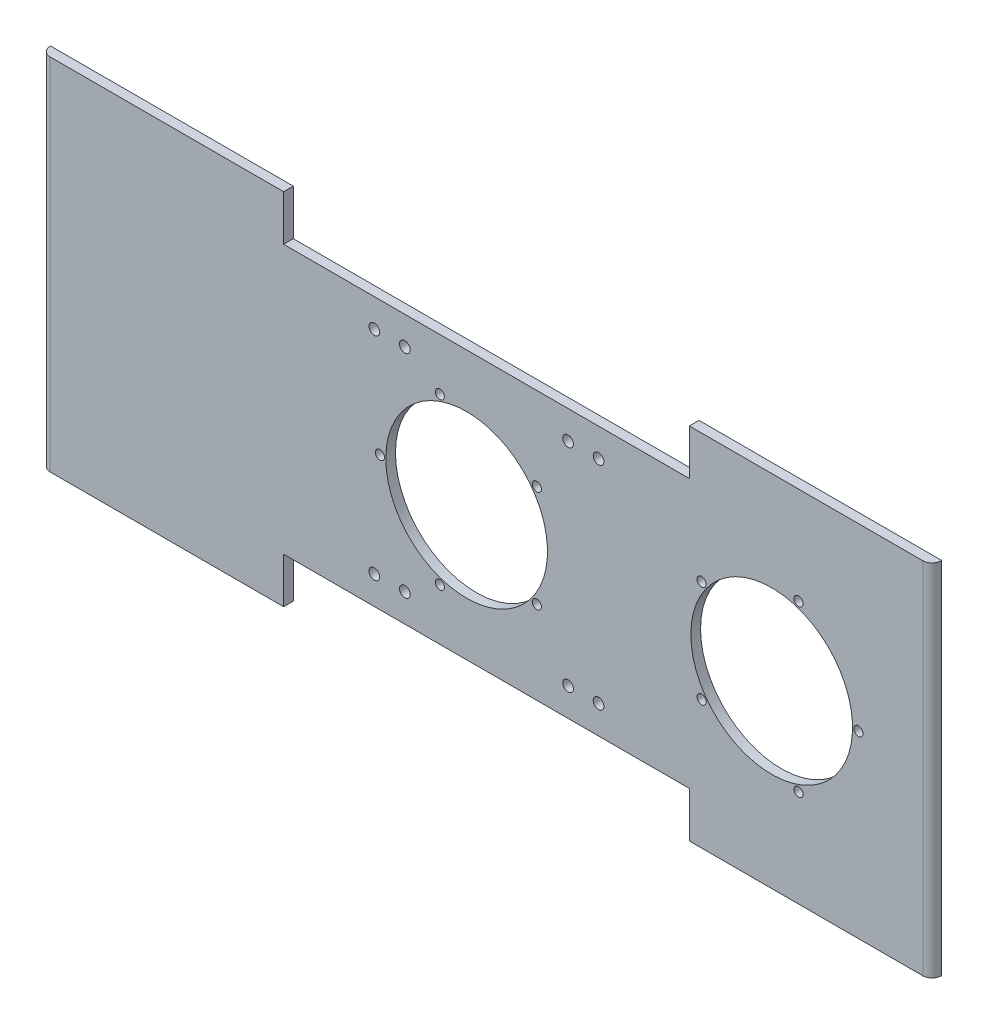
ISO-10303-21;
HEADER;
FILE_DESCRIPTION(('STEP AP214'),'2;1');
FILE_NAME('part.step','',(''),(''),'','','');
FILE_SCHEMA(('AUTOMOTIVE_DESIGN { 1 0 10303 214 1 1 1 1 }'));
ENDSEC;
DATA;
#1=APPLICATION_CONTEXT('core data for automotive mechanical design processes');
#2=APPLICATION_PROTOCOL_DEFINITION('international standard','automotive_design',2000,#1);
#3=PRODUCT_CONTEXT('',#1,'mechanical');
#4=PRODUCT('Part','Part','',(#3));
#5=PRODUCT_RELATED_PRODUCT_CATEGORY('part','',(#4));
#6=PRODUCT_DEFINITION_FORMATION('','',#4);
#7=PRODUCT_DEFINITION_CONTEXT('part definition',#1,'design');
#8=PRODUCT_DEFINITION('design','',#6,#7);
#9=PRODUCT_DEFINITION_SHAPE('','',#8);
#10=(LENGTH_UNIT() NAMED_UNIT(*) SI_UNIT(.MILLI.,.METRE.));
#11=(NAMED_UNIT(*) PLANE_ANGLE_UNIT() SI_UNIT($,.RADIAN.));
#12=(NAMED_UNIT(*) SI_UNIT($,.STERADIAN.) SOLID_ANGLE_UNIT());
#13=UNCERTAINTY_MEASURE_WITH_UNIT(LENGTH_MEASURE(1.E-05),#10,'distance_accuracy_value','');
#14=(GEOMETRIC_REPRESENTATION_CONTEXT(3) GLOBAL_UNCERTAINTY_ASSIGNED_CONTEXT((#13)) GLOBAL_UNIT_ASSIGNED_CONTEXT((#10,
#11,#12)) REPRESENTATION_CONTEXT('',''));
#15=CARTESIAN_POINT('',(0.,0.,0.));
#16=DIRECTION('',(0.,0.,1.));
#17=DIRECTION('',(1.,0.,0.));
#18=AXIS2_PLACEMENT_3D('',#15,#16,#17);
#19=CARTESIAN_POINT('',(0.,58.9125,-240.705250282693));
#20=DIRECTION('',(0.,1.,0.));
#21=DIRECTION('',(0.,0.,1.));
#22=AXIS2_PLACEMENT_3D('',#19,#20,#21);
#23=PLANE('',#22);
#24=DIRECTION('',(0.,0.,1.));
#25=VECTOR('',#24,1.);
#26=CARTESIAN_POINT('',(-146.05,58.9125,0.));
#27=LINE('',#26,#25);
#28=CARTESIAN_POINT('',(-146.05,58.9125,142.875));
#29=VERTEX_POINT('',#28);
#30=CARTESIAN_POINT('',(-146.05,58.9125,143.05));
#31=VERTEX_POINT('',#30);
#32=EDGE_CURVE('E211',#29,#31,#27,.T.);
#33=ORIENTED_EDGE('',*,*,#32,.T.);
#34=CARTESIAN_POINT('',(-143.05,58.9125,143.05));
#35=DIRECTION('',(0.,1.,0.));
#36=DIRECTION('',(0.,0.,1.));
#37=AXIS2_PLACEMENT_3D('',#34,#35,#36);
#38=CIRCLE('',#37,3.);
#39=CARTESIAN_POINT('',(-143.05,58.9125,146.05));
#40=VERTEX_POINT('',#39);
#41=EDGE_CURVE('E11',#31,#40,#38,.T.);
#42=ORIENTED_EDGE('',*,*,#41,.T.);
#43=DIRECTION('',(1.,0.,0.));
#44=VECTOR('',#43,1.);
#45=CARTESIAN_POINT('',(0.,58.9125,146.05));
#46=LINE('',#45,#44);
#47=CARTESIAN_POINT('',(-66.5,58.9125,146.05));
#48=VERTEX_POINT('',#47);
#49=EDGE_CURVE('E222',#40,#48,#46,.T.);
#50=ORIENTED_EDGE('',*,*,#49,.T.);
#51=DIRECTION('',(0.,0.,1.));
#52=VECTOR('',#51,1.);
#53=CARTESIAN_POINT('',(-66.5,58.9125,8.67285394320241));
#54=LINE('',#53,#52);
#55=CARTESIAN_POINT('',(-66.5,58.9125,142.875));
#56=VERTEX_POINT('',#55);
#57=EDGE_CURVE('E179',#56,#48,#54,.T.);
#58=ORIENTED_EDGE('',*,*,#57,.F.);
#59=DIRECTION('',(1.,0.,0.));
#60=VECTOR('',#59,1.);
#61=CARTESIAN_POINT('',(0.,58.9125,142.875));
#62=LINE('',#61,#60);
#63=EDGE_CURVE('E215',#29,#56,#62,.T.);
#64=ORIENTED_EDGE('',*,*,#63,.F.);
#65=EDGE_LOOP('',(#33,#42,#50,#58,#64));
#66=FACE_BOUND('',#65,.T.);
#67=ADVANCED_FACE('F36',(#66),#23,.T.);
#68=CARTESIAN_POINT('',(0.,-58.9125,-240.705250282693));
#69=DIRECTION('',(0.,-1.,0.));
#70=DIRECTION('',(0.,0.,1.));
#71=AXIS2_PLACEMENT_3D('',#68,#69,#70);
#72=PLANE('',#71);
#73=DIRECTION('',(0.,0.,1.));
#74=VECTOR('',#73,1.);
#75=CARTESIAN_POINT('',(146.05,-58.9125,0.));
#76=LINE('',#75,#74);
#77=CARTESIAN_POINT('',(146.05,-58.9125,142.875));
#78=VERTEX_POINT('',#77);
#79=CARTESIAN_POINT('',(146.05,-58.9125,143.05));
#80=VERTEX_POINT('',#79);
#81=EDGE_CURVE('E204',#78,#80,#76,.T.);
#82=ORIENTED_EDGE('',*,*,#81,.T.);
#83=CARTESIAN_POINT('',(143.05,-58.9125,143.05));
#84=DIRECTION('',(0.,-1.,0.));
#85=DIRECTION('',(0.,0.,-1.));
#86=AXIS2_PLACEMENT_3D('',#83,#84,#85);
#87=CIRCLE('',#86,3.);
#88=CARTESIAN_POINT('',(143.05,-58.9125,146.05));
#89=VERTEX_POINT('',#88);
#90=EDGE_CURVE('E243',#80,#89,#87,.T.);
#91=ORIENTED_EDGE('',*,*,#90,.T.);
#92=DIRECTION('',(1.,0.,0.));
#93=VECTOR('',#92,1.);
#94=CARTESIAN_POINT('',(0.,-58.9125,146.05));
#95=LINE('',#94,#93);
#96=CARTESIAN_POINT('',(66.5,-58.9125,146.05));
#97=VERTEX_POINT('',#96);
#98=EDGE_CURVE('E171',#97,#89,#95,.T.);
#99=ORIENTED_EDGE('',*,*,#98,.F.);
#100=DIRECTION('',(0.,0.,1.));
#101=VECTOR('',#100,1.);
#102=CARTESIAN_POINT('',(66.5,-58.9125,-240.705250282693));
#103=LINE('',#102,#101);
#104=CARTESIAN_POINT('',(66.5,-58.9125,142.875));
#105=VERTEX_POINT('',#104);
#106=EDGE_CURVE('E229',#105,#97,#103,.T.);
#107=ORIENTED_EDGE('',*,*,#106,.F.);
#108=DIRECTION('',(1.,0.,0.));
#109=VECTOR('',#108,1.);
#110=CARTESIAN_POINT('',(0.,-58.9125,142.875));
#111=LINE('',#110,#109);
#112=EDGE_CURVE('E202',#105,#78,#111,.T.);
#113=ORIENTED_EDGE('',*,*,#112,.T.);
#114=EDGE_LOOP('',(#82,#91,#99,#107,#113));
#115=FACE_BOUND('',#114,.T.);
#116=ADVANCED_FACE('F268',(#115),#72,.T.);
#117=CARTESIAN_POINT('',(146.05,351.029754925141,0.));
#118=DIRECTION('',(1.,0.,0.));
#119=DIRECTION('',(0.,0.,-1.));
#120=AXIS2_PLACEMENT_3D('',#117,#118,#119);
#121=PLANE('',#120);
#122=DIRECTION('',(0.,0.,1.));
#123=VECTOR('',#122,1.);
#124=CARTESIAN_POINT('',(146.05,58.9125,0.));
#125=LINE('',#124,#123);
#126=CARTESIAN_POINT('',(146.05,58.9125,142.875));
#127=VERTEX_POINT('',#126);
#128=CARTESIAN_POINT('',(146.05,58.9125,143.05));
#129=VERTEX_POINT('',#128);
#130=EDGE_CURVE('E207',#127,#129,#125,.T.);
#131=ORIENTED_EDGE('',*,*,#130,.T.);
#132=DIRECTION('',(0.,-1.,0.));
#133=VECTOR('',#132,1.);
#134=CARTESIAN_POINT('',(146.05,-58.9125,143.05));
#135=LINE('',#134,#133);
#136=EDGE_CURVE('E231',#129,#80,#135,.T.);
#137=ORIENTED_EDGE('',*,*,#136,.T.);
#138=ORIENTED_EDGE('',*,*,#81,.F.);
#139=DIRECTION('',(0.,-1.,0.));
#140=VECTOR('',#139,1.);
#141=CARTESIAN_POINT('',(146.05,351.029754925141,142.875));
#142=LINE('',#141,#140);
#143=EDGE_CURVE('E218',#127,#78,#142,.T.);
#144=ORIENTED_EDGE('',*,*,#143,.F.);
#145=EDGE_LOOP('',(#131,#137,#138,#144));
#146=FACE_BOUND('',#145,.T.);
#147=ADVANCED_FACE('F263',(#146),#121,.T.);
#148=CARTESIAN_POINT('',(0.,351.029754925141,142.875));
#149=DIRECTION('',(0.,0.,-1.));
#150=DIRECTION('',(-1.,0.,0.));
#151=AXIS2_PLACEMENT_3D('',#148,#149,#150);
#152=PLANE('',#151);
#153=CARTESIAN_POINT('',(36.75,-34.74,142.875));
#154=DIRECTION('',(0.,0.,-1.));
#155=DIRECTION('',(-1.,0.,0.));
#156=AXIS2_PLACEMENT_3D('',#153,#154,#155);
#157=CIRCLE('',#156,1.75);
#158=CARTESIAN_POINT('',(35.,-34.74,142.875));
#159=VERTEX_POINT('',#158);
#160=EDGE_CURVE('E550',#159,#159,#157,.F.);
#161=ORIENTED_EDGE('',*,*,#160,.T.);
#162=EDGE_LOOP('',(#161));
#163=FACE_BOUND('',#162,.T.);
#164=CARTESIAN_POINT('',(26.75,-34.74,142.875));
#165=DIRECTION('',(0.,0.,-1.));
#166=DIRECTION('',(-1.,0.,0.));
#167=AXIS2_PLACEMENT_3D('',#164,#165,#166);
#168=CIRCLE('',#167,1.75);
#169=CARTESIAN_POINT('',(25.,-34.74,142.875));
#170=VERTEX_POINT('',#169);
#171=EDGE_CURVE('E560',#170,#170,#168,.F.);
#172=ORIENTED_EDGE('',*,*,#171,.T.);
#173=EDGE_LOOP('',(#172));
#174=FACE_BOUND('',#173,.T.);
#175=CARTESIAN_POINT('',(-26.75,-34.74,142.875));
#176=DIRECTION('',(0.,0.,-1.));
#177=DIRECTION('',(-1.,0.,0.));
#178=AXIS2_PLACEMENT_3D('',#175,#176,#177);
#179=CIRCLE('',#178,1.75);
#180=CARTESIAN_POINT('',(-28.5,-34.74,142.875));
#181=VERTEX_POINT('',#180);
#182=EDGE_CURVE('E566',#181,#181,#179,.F.);
#183=ORIENTED_EDGE('',*,*,#182,.T.);
#184=EDGE_LOOP('',(#183));
#185=FACE_BOUND('',#184,.T.);
#186=CARTESIAN_POINT('',(-36.75,-34.74,142.875));
#187=DIRECTION('',(0.,0.,-1.));
#188=DIRECTION('',(-1.,0.,0.));
#189=AXIS2_PLACEMENT_3D('',#186,#187,#188);
#190=CIRCLE('',#189,1.75);
#191=CARTESIAN_POINT('',(-38.5,-34.74,142.875));
#192=VERTEX_POINT('',#191);
#193=EDGE_CURVE('E572',#192,#192,#190,.F.);
#194=ORIENTED_EDGE('',*,*,#193,.T.);
#195=EDGE_LOOP('',(#194));
#196=FACE_BOUND('',#195,.T.);
#197=CARTESIAN_POINT('',(-36.75,34.74,142.875));
#198=DIRECTION('',(0.,0.,-1.));
#199=DIRECTION('',(-1.,0.,0.));
#200=AXIS2_PLACEMENT_3D('',#197,#198,#199);
#201=CIRCLE('',#200,1.75);
#202=CARTESIAN_POINT('',(-38.5,34.74,142.875));
#203=VERTEX_POINT('',#202);
#204=EDGE_CURVE('E578',#203,#203,#201,.F.);
#205=ORIENTED_EDGE('',*,*,#204,.T.);
#206=EDGE_LOOP('',(#205));
#207=FACE_BOUND('',#206,.T.);
#208=CARTESIAN_POINT('',(-26.75,34.74,142.875));
#209=DIRECTION('',(0.,0.,-1.));
#210=DIRECTION('',(-1.,0.,0.));
#211=AXIS2_PLACEMENT_3D('',#208,#209,#210);
#212=CIRCLE('',#211,1.75);
#213=CARTESIAN_POINT('',(-28.5,34.74,142.875));
#214=VERTEX_POINT('',#213);
#215=EDGE_CURVE('E584',#214,#214,#212,.F.);
#216=ORIENTED_EDGE('',*,*,#215,.T.);
#217=EDGE_LOOP('',(#216));
#218=FACE_BOUND('',#217,.T.);
#219=CARTESIAN_POINT('',(26.75,34.74,142.875));
#220=DIRECTION('',(0.,0.,-1.));
#221=DIRECTION('',(-1.,0.,0.));
#222=AXIS2_PLACEMENT_3D('',#219,#220,#221);
#223=CIRCLE('',#222,1.75);
#224=CARTESIAN_POINT('',(25.,34.74,142.875));
#225=VERTEX_POINT('',#224);
#226=EDGE_CURVE('E590',#225,#225,#223,.F.);
#227=ORIENTED_EDGE('',*,*,#226,.T.);
#228=EDGE_LOOP('',(#227));
#229=FACE_BOUND('',#228,.T.);
#230=CARTESIAN_POINT('',(36.75,34.74,142.875));
#231=DIRECTION('',(0.,0.,-1.));
#232=DIRECTION('',(-1.,0.,0.));
#233=AXIS2_PLACEMENT_3D('',#230,#231,#232);
#234=CIRCLE('',#233,1.75);
#235=CARTESIAN_POINT('',(35.,34.74,142.875));
#236=VERTEX_POINT('',#235);
#237=EDGE_CURVE('E596',#236,#236,#234,.F.);
#238=ORIENTED_EDGE('',*,*,#237,.T.);
#239=EDGE_LOOP('',(#238));
#240=FACE_BOUND('',#239,.T.);
#241=CARTESIAN_POINT('',(-6.50000000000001,0.,142.875));
#242=DIRECTION('',(0.,0.,-1.));
#243=DIRECTION('',(-1.,0.,0.));
#244=AXIS2_PLACEMENT_3D('',#241,#242,#243);
#245=CIRCLE('',#244,26.5);
#246=CARTESIAN_POINT('',(-33.,0.,142.875));
#247=VERTEX_POINT('',#246);
#248=EDGE_CURVE('E240',#247,#247,#245,.T.);
#249=ORIENTED_EDGE('',*,*,#248,.F.);
#250=EDGE_LOOP('',(#249));
#251=FACE_BOUND('',#250,.T.);
#252=CARTESIAN_POINT('',(93.5,0.,142.875));
#253=DIRECTION('',(0.,0.,-1.));
#254=DIRECTION('',(-1.,0.,0.));
#255=AXIS2_PLACEMENT_3D('',#252,#253,#254);
#256=CIRCLE('',#255,26.5);
#257=CARTESIAN_POINT('',(67.,0.,142.875));
#258=VERTEX_POINT('',#257);
#259=EDGE_CURVE('E235',#258,#258,#256,.T.);
#260=ORIENTED_EDGE('',*,*,#259,.F.);
#261=EDGE_LOOP('',(#260));
#262=FACE_BOUND('',#261,.T.);
#263=CARTESIAN_POINT('',(16.4963080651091,16.7077957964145,142.875));
#264=DIRECTION('',(0.,0.,-1.));
#265=DIRECTION('',(-1.,0.,0.));
#266=AXIS2_PLACEMENT_3D('',#263,#264,#265);
#267=CIRCLE('',#266,1.5);
#268=CARTESIAN_POINT('',(14.9963080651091,16.7077957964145,142.875));
#269=VERTEX_POINT('',#268);
#270=EDGE_CURVE('E613',#269,#269,#267,.F.);
#271=ORIENTED_EDGE('',*,*,#270,.T.);
#272=EDGE_LOOP('',(#271));
#273=FACE_BOUND('',#272,.T.);
#274=CARTESIAN_POINT('',(16.4963080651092,-16.7077957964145,142.875));
#275=DIRECTION('',(0.,0.,-1.));
#276=DIRECTION('',(-1.,0.,0.));
#277=AXIS2_PLACEMENT_3D('',#274,#275,#276);
#278=CIRCLE('',#277,1.5);
#279=CARTESIAN_POINT('',(14.9963080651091,-16.7077957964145,142.875));
#280=VERTEX_POINT('',#279);
#281=EDGE_CURVE('E619',#280,#280,#278,.F.);
#282=ORIENTED_EDGE('',*,*,#281,.T.);
#283=EDGE_LOOP('',(#282));
#284=FACE_BOUND('',#283,.T.);
#285=CARTESIAN_POINT('',(-15.2838080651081,-27.0337814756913,142.875));
#286=DIRECTION('',(0.,0.,-1.));
#287=DIRECTION('',(-1.,0.,0.));
#288=AXIS2_PLACEMENT_3D('',#285,#286,#287);
#289=CIRCLE('',#288,1.5);
#290=CARTESIAN_POINT('',(-16.7838080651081,-27.0337814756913,142.875));
#291=VERTEX_POINT('',#290);
#292=EDGE_CURVE('E625',#291,#291,#289,.F.);
#293=ORIENTED_EDGE('',*,*,#292,.T.);
#294=EDGE_LOOP('',(#293));
#295=FACE_BOUND('',#294,.T.);
#296=CARTESIAN_POINT('',(-34.9250000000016,-1.65882932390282E-13,142.875));
#297=DIRECTION('',(0.,0.,-1.));
#298=DIRECTION('',(-1.,0.,0.));
#299=AXIS2_PLACEMENT_3D('',#296,#297,#298);
#300=CIRCLE('',#299,1.50000000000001);
#301=CARTESIAN_POINT('',(-36.4250000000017,-1.65882932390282E-13,142.875));
#302=VERTEX_POINT('',#301);
#303=EDGE_CURVE('E631',#302,#302,#300,.F.);
#304=ORIENTED_EDGE('',*,*,#303,.T.);
#305=EDGE_LOOP('',(#304));
#306=FACE_BOUND('',#305,.T.);
#307=CARTESIAN_POINT('',(102.283808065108,27.0337814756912,142.875));
#308=DIRECTION('',(0.,0.,-1.));
#309=DIRECTION('',(-1.,0.,0.));
#310=AXIS2_PLACEMENT_3D('',#307,#308,#309);
#311=CIRCLE('',#310,1.5);
#312=CARTESIAN_POINT('',(100.783808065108,27.0337814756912,142.875));
#313=VERTEX_POINT('',#312);
#314=EDGE_CURVE('E637',#313,#313,#311,.F.);
#315=ORIENTED_EDGE('',*,*,#314,.T.);
#316=EDGE_LOOP('',(#315));
#317=FACE_BOUND('',#316,.T.);
#318=CARTESIAN_POINT('',(121.925000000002,-1.83880688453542E-13,142.875));
#319=DIRECTION('',(0.,0.,-1.));
#320=DIRECTION('',(-1.,0.,0.));
#321=AXIS2_PLACEMENT_3D('',#318,#319,#320);
#322=CIRCLE('',#321,1.50000000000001);
#323=CARTESIAN_POINT('',(120.425000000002,-1.83880688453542E-13,142.875));
#324=VERTEX_POINT('',#323);
#325=EDGE_CURVE('E643',#324,#324,#322,.F.);
#326=ORIENTED_EDGE('',*,*,#325,.T.);
#327=EDGE_LOOP('',(#326));
#328=FACE_BOUND('',#327,.T.);
#329=CARTESIAN_POINT('',(70.5036919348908,16.7077957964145,142.875));
#330=DIRECTION('',(0.,0.,-1.));
#331=DIRECTION('',(-1.,0.,0.));
#332=AXIS2_PLACEMENT_3D('',#329,#330,#331);
#333=CIRCLE('',#332,1.5);
#334=CARTESIAN_POINT('',(69.0036919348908,16.7077957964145,142.875));
#335=VERTEX_POINT('',#334);
#336=EDGE_CURVE('E649',#335,#335,#333,.F.);
#337=ORIENTED_EDGE('',*,*,#336,.T.);
#338=EDGE_LOOP('',(#337));
#339=FACE_BOUND('',#338,.T.);
#340=CARTESIAN_POINT('',(70.5036919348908,-16.7077957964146,142.875));
#341=DIRECTION('',(0.,0.,-1.));
#342=DIRECTION('',(-1.,0.,0.));
#343=AXIS2_PLACEMENT_3D('',#340,#341,#342);
#344=CIRCLE('',#343,1.50000000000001);
#345=CARTESIAN_POINT('',(69.0036919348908,-16.7077957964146,142.875));
#346=VERTEX_POINT('',#345);
#347=EDGE_CURVE('E606',#346,#346,#344,.F.);
#348=ORIENTED_EDGE('',*,*,#347,.T.);
#349=EDGE_LOOP('',(#348));
#350=FACE_BOUND('',#349,.T.);
#351=CARTESIAN_POINT('',(102.283808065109,-27.0337814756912,142.875));
#352=DIRECTION('',(0.,0.,-1.));
#353=DIRECTION('',(-1.,0.,0.));
#354=AXIS2_PLACEMENT_3D('',#351,#352,#353);
#355=CIRCLE('',#354,1.50000000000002);
#356=CARTESIAN_POINT('',(100.783808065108,-27.0337814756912,142.875));
#357=VERTEX_POINT('',#356);
#358=EDGE_CURVE('E602',#357,#357,#355,.F.);
#359=ORIENTED_EDGE('',*,*,#358,.T.);
#360=EDGE_LOOP('',(#359));
#361=FACE_BOUND('',#360,.T.);
#362=CARTESIAN_POINT('',(-15.2838080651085,27.0337814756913,142.875));
#363=DIRECTION('',(0.,0.,-1.));
#364=DIRECTION('',(-1.,0.,0.));
#365=AXIS2_PLACEMENT_3D('',#362,#363,#364);
#366=CIRCLE('',#365,1.5);
#367=CARTESIAN_POINT('',(-16.7838080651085,27.0337814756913,142.875));
#368=VERTEX_POINT('',#367);
#369=EDGE_CURVE('E612',#368,#368,#366,.F.);
#370=ORIENTED_EDGE('',*,*,#369,.T.);
#371=EDGE_LOOP('',(#370));
#372=FACE_BOUND('',#371,.T.);
#373=DIRECTION('',(0.,1.,0.));
#374=VECTOR('',#373,1.);
#375=CARTESIAN_POINT('',(66.5,-43.99,142.875));
#376=LINE('',#375,#374);
#377=CARTESIAN_POINT('',(66.5,-43.99,142.875));
#378=VERTEX_POINT('',#377);
#379=EDGE_CURVE('E156',#105,#378,#376,.T.);
#380=ORIENTED_EDGE('',*,*,#379,.T.);
#381=DIRECTION('',(-1.,0.,0.));
#382=VECTOR('',#381,1.);
#383=CARTESIAN_POINT('',(-66.5,-43.99,142.875));
#384=LINE('',#383,#382);
#385=CARTESIAN_POINT('',(-66.5,-43.99,142.875));
#386=VERTEX_POINT('',#385);
#387=EDGE_CURVE('E146',#378,#386,#384,.T.);
#388=ORIENTED_EDGE('',*,*,#387,.T.);
#389=DIRECTION('',(0.,-1.,0.));
#390=VECTOR('',#389,1.);
#391=CARTESIAN_POINT('',(-66.5,-43.99,142.875));
#392=LINE('',#391,#390);
#393=CARTESIAN_POINT('',(-66.5,-58.9125,142.875));
#394=VERTEX_POINT('',#393);
#395=EDGE_CURVE('E143',#386,#394,#392,.T.);
#396=ORIENTED_EDGE('',*,*,#395,.T.);
#397=CARTESIAN_POINT('',(-146.05,-58.9125,142.875));
#398=VERTEX_POINT('',#397);
#399=EDGE_CURVE('E208',#398,#394,#111,.T.);
#400=ORIENTED_EDGE('',*,*,#399,.F.);
#401=DIRECTION('',(0.,-1.,0.));
#402=VECTOR('',#401,1.);
#403=CARTESIAN_POINT('',(-146.05,351.029754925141,142.875));
#404=LINE('',#403,#402);
#405=EDGE_CURVE('E214',#29,#398,#404,.T.);
#406=ORIENTED_EDGE('',*,*,#405,.F.);
#407=ORIENTED_EDGE('',*,*,#63,.T.);
#408=DIRECTION('',(0.,-1.,0.));
#409=VECTOR('',#408,1.);
#410=CARTESIAN_POINT('',(-66.5,58.9125,142.875));
#411=LINE('',#410,#409);
#412=CARTESIAN_POINT('',(-66.5,43.99,142.875));
#413=VERTEX_POINT('',#412);
#414=EDGE_CURVE('E193',#56,#413,#411,.T.);
#415=ORIENTED_EDGE('',*,*,#414,.T.);
#416=DIRECTION('',(1.,0.,0.));
#417=VECTOR('',#416,1.);
#418=CARTESIAN_POINT('',(66.5,43.99,142.875));
#419=LINE('',#418,#417);
#420=CARTESIAN_POINT('',(66.5,43.99,142.875));
#421=VERTEX_POINT('',#420);
#422=EDGE_CURVE('E189',#413,#421,#419,.T.);
#423=ORIENTED_EDGE('',*,*,#422,.T.);
#424=DIRECTION('',(0.,1.,0.));
#425=VECTOR('',#424,1.);
#426=CARTESIAN_POINT('',(66.5,58.9125,142.875));
#427=LINE('',#426,#425);
#428=CARTESIAN_POINT('',(66.5,58.9125,142.875));
#429=VERTEX_POINT('',#428);
#430=EDGE_CURVE('E167',#421,#429,#427,.T.);
#431=ORIENTED_EDGE('',*,*,#430,.T.);
#432=EDGE_CURVE('E219',#429,#127,#62,.T.);
#433=ORIENTED_EDGE('',*,*,#432,.T.);
#434=ORIENTED_EDGE('',*,*,#143,.T.);
#435=ORIENTED_EDGE('',*,*,#112,.F.);
#436=EDGE_LOOP('',(#380,#388,#396,#400,#406,#407,#415,#423,#431,#433,#434,#435));
#437=FACE_BOUND('',#436,.T.);
#438=ADVANCED_FACE('F274',(#163,#174,#185,#196,#207,#218,#229,#240,#251,#262,#273,#284,#295,
#306,#317,#328,#339,#350,#361,#372,#437),#152,.T.);
#439=CARTESIAN_POINT('',(-146.05,351.029754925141,0.));
#440=DIRECTION('',(1.,0.,0.));
#441=DIRECTION('',(0.,0.,-1.));
#442=AXIS2_PLACEMENT_3D('',#439,#440,#441);
#443=PLANE('',#442);
#444=DIRECTION('',(0.,0.,1.));
#445=VECTOR('',#444,1.);
#446=CARTESIAN_POINT('',(-146.05,-58.9125,0.));
#447=LINE('',#446,#445);
#448=CARTESIAN_POINT('',(-146.05,-58.9125,143.05));
#449=VERTEX_POINT('',#448);
#450=EDGE_CURVE('E200',#398,#449,#447,.T.);
#451=ORIENTED_EDGE('',*,*,#450,.T.);
#452=DIRECTION('',(0.,-1.,0.));
#453=VECTOR('',#452,1.);
#454=CARTESIAN_POINT('',(-146.05,351.029754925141,143.05));
#455=LINE('',#454,#453);
#456=EDGE_CURVE('E44',#449,#31,#455,.F.);
#457=ORIENTED_EDGE('',*,*,#456,.T.);
#458=ORIENTED_EDGE('',*,*,#32,.F.);
#459=ORIENTED_EDGE('',*,*,#405,.T.);
#460=EDGE_LOOP('',(#451,#457,#458,#459));
#461=FACE_BOUND('',#460,.T.);
#462=ADVANCED_FACE('F294',(#461),#443,.F.);
#463=CARTESIAN_POINT('',(0.,351.029754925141,146.05));
#464=DIRECTION('',(0.,0.,-1.));
#465=DIRECTION('',(-1.,0.,0.));
#466=AXIS2_PLACEMENT_3D('',#463,#464,#465);
#467=PLANE('',#466);
#468=CARTESIAN_POINT('',(36.75,-34.74,146.05));
#469=DIRECTION('',(0.,0.,1.));
#470=DIRECTION('',(1.,0.,0.));
#471=AXIS2_PLACEMENT_3D('',#468,#469,#470);
#472=CIRCLE('',#471,1.75);
#473=CARTESIAN_POINT('',(38.5,-34.74,146.05));
#474=VERTEX_POINT('',#473);
#475=EDGE_CURVE('E236',#474,#474,#472,.T.);
#476=ORIENTED_EDGE('',*,*,#475,.F.);
#477=EDGE_LOOP('',(#476));
#478=FACE_BOUND('',#477,.T.);
#479=CARTESIAN_POINT('',(26.75,-34.74,146.05));
#480=DIRECTION('',(0.,0.,1.));
#481=DIRECTION('',(1.,0.,0.));
#482=AXIS2_PLACEMENT_3D('',#479,#480,#481);
#483=CIRCLE('',#482,1.75);
#484=CARTESIAN_POINT('',(28.5,-34.74,146.05));
#485=VERTEX_POINT('',#484);
#486=EDGE_CURVE('E555',#485,#485,#483,.T.);
#487=ORIENTED_EDGE('',*,*,#486,.F.);
#488=EDGE_LOOP('',(#487));
#489=FACE_BOUND('',#488,.T.);
#490=CARTESIAN_POINT('',(-26.75,-34.74,146.05));
#491=DIRECTION('',(0.,0.,1.));
#492=DIRECTION('',(-1.,0.,0.));
#493=AXIS2_PLACEMENT_3D('',#490,#491,#492);
#494=CIRCLE('',#493,1.75);
#495=CARTESIAN_POINT('',(-28.5,-34.74,146.05));
#496=VERTEX_POINT('',#495);
#497=EDGE_CURVE('E563',#496,#496,#494,.T.);
#498=ORIENTED_EDGE('',*,*,#497,.F.);
#499=EDGE_LOOP('',(#498));
#500=FACE_BOUND('',#499,.T.);
#501=CARTESIAN_POINT('',(-36.75,-34.74,146.05));
#502=DIRECTION('',(0.,0.,1.));
#503=DIRECTION('',(-1.,0.,0.));
#504=AXIS2_PLACEMENT_3D('',#501,#502,#503);
#505=CIRCLE('',#504,1.75);
#506=CARTESIAN_POINT('',(-38.5,-34.74,146.05));
#507=VERTEX_POINT('',#506);
#508=EDGE_CURVE('E569',#507,#507,#505,.T.);
#509=ORIENTED_EDGE('',*,*,#508,.F.);
#510=EDGE_LOOP('',(#509));
#511=FACE_BOUND('',#510,.T.);
#512=CARTESIAN_POINT('',(-36.75,34.74,146.05));
#513=DIRECTION('',(0.,0.,1.));
#514=DIRECTION('',(1.,0.,0.));
#515=AXIS2_PLACEMENT_3D('',#512,#513,#514);
#516=CIRCLE('',#515,1.75);
#517=CARTESIAN_POINT('',(-35.,34.74,146.05));
#518=VERTEX_POINT('',#517);
#519=EDGE_CURVE('E575',#518,#518,#516,.T.);
#520=ORIENTED_EDGE('',*,*,#519,.F.);
#521=EDGE_LOOP('',(#520));
#522=FACE_BOUND('',#521,.T.);
#523=CARTESIAN_POINT('',(-26.75,34.74,146.05));
#524=DIRECTION('',(0.,0.,1.));
#525=DIRECTION('',(1.,0.,0.));
#526=AXIS2_PLACEMENT_3D('',#523,#524,#525);
#527=CIRCLE('',#526,1.75);
#528=CARTESIAN_POINT('',(-25.,34.74,146.05));
#529=VERTEX_POINT('',#528);
#530=EDGE_CURVE('E581',#529,#529,#527,.T.);
#531=ORIENTED_EDGE('',*,*,#530,.F.);
#532=EDGE_LOOP('',(#531));
#533=FACE_BOUND('',#532,.T.);
#534=CARTESIAN_POINT('',(26.75,34.74,146.05));
#535=DIRECTION('',(0.,0.,1.));
#536=DIRECTION('',(-1.,0.,0.));
#537=AXIS2_PLACEMENT_3D('',#534,#535,#536);
#538=CIRCLE('',#537,1.75);
#539=CARTESIAN_POINT('',(25.,34.74,146.05));
#540=VERTEX_POINT('',#539);
#541=EDGE_CURVE('E587',#540,#540,#538,.T.);
#542=ORIENTED_EDGE('',*,*,#541,.F.);
#543=EDGE_LOOP('',(#542));
#544=FACE_BOUND('',#543,.T.);
#545=CARTESIAN_POINT('',(36.75,34.74,146.05));
#546=DIRECTION('',(0.,0.,1.));
#547=DIRECTION('',(-1.,0.,0.));
#548=AXIS2_PLACEMENT_3D('',#545,#546,#547);
#549=CIRCLE('',#548,1.75);
#550=CARTESIAN_POINT('',(35.,34.74,146.05));
#551=VERTEX_POINT('',#550);
#552=EDGE_CURVE('E593',#551,#551,#549,.T.);
#553=ORIENTED_EDGE('',*,*,#552,.F.);
#554=EDGE_LOOP('',(#553));
#555=FACE_BOUND('',#554,.T.);
#556=CARTESIAN_POINT('',(-6.50000000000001,0.,146.05));
#557=DIRECTION('',(0.,0.,-1.));
#558=DIRECTION('',(-1.,0.,0.));
#559=AXIS2_PLACEMENT_3D('',#556,#557,#558);
#560=CIRCLE('',#559,26.5);
#561=CARTESIAN_POINT('',(-33.,0.,146.05));
#562=VERTEX_POINT('',#561);
#563=EDGE_CURVE('E237',#562,#562,#560,.T.);
#564=ORIENTED_EDGE('',*,*,#563,.T.);
#565=EDGE_LOOP('',(#564));
#566=FACE_BOUND('',#565,.T.);
#567=CARTESIAN_POINT('',(93.5,0.,146.05));
#568=DIRECTION('',(0.,0.,-1.));
#569=DIRECTION('',(-1.,0.,0.));
#570=AXIS2_PLACEMENT_3D('',#567,#568,#569);
#571=CIRCLE('',#570,26.5);
#572=CARTESIAN_POINT('',(67.,0.,146.05));
#573=VERTEX_POINT('',#572);
#574=EDGE_CURVE('E232',#573,#573,#571,.T.);
#575=ORIENTED_EDGE('',*,*,#574,.T.);
#576=EDGE_LOOP('',(#575));
#577=FACE_BOUND('',#576,.T.);
#578=CARTESIAN_POINT('',(16.4963080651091,16.7077957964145,146.05));
#579=DIRECTION('',(0.,0.,1.));
#580=DIRECTION('',(1.,0.,0.));
#581=AXIS2_PLACEMENT_3D('',#578,#579,#580);
#582=CIRCLE('',#581,1.5);
#583=CARTESIAN_POINT('',(17.9963080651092,16.7077957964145,146.05));
#584=VERTEX_POINT('',#583);
#585=EDGE_CURVE('E609',#584,#584,#582,.T.);
#586=ORIENTED_EDGE('',*,*,#585,.F.);
#587=EDGE_LOOP('',(#586));
#588=FACE_BOUND('',#587,.T.);
#589=CARTESIAN_POINT('',(16.4963080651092,-16.7077957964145,146.05));
#590=DIRECTION('',(0.,0.,1.));
#591=DIRECTION('',(1.,0.,0.));
#592=AXIS2_PLACEMENT_3D('',#589,#590,#591);
#593=CIRCLE('',#592,1.5);
#594=CARTESIAN_POINT('',(17.9963080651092,-16.7077957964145,146.05));
#595=VERTEX_POINT('',#594);
#596=EDGE_CURVE('E616',#595,#595,#593,.T.);
#597=ORIENTED_EDGE('',*,*,#596,.F.);
#598=EDGE_LOOP('',(#597));
#599=FACE_BOUND('',#598,.T.);
#600=CARTESIAN_POINT('',(-15.2838080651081,-27.0337814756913,146.05));
#601=DIRECTION('',(0.,0.,1.));
#602=DIRECTION('',(1.,0.,0.));
#603=AXIS2_PLACEMENT_3D('',#600,#601,#602);
#604=CIRCLE('',#603,1.5);
#605=CARTESIAN_POINT('',(-13.7838080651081,-27.0337814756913,146.05));
#606=VERTEX_POINT('',#605);
#607=EDGE_CURVE('E622',#606,#606,#604,.T.);
#608=ORIENTED_EDGE('',*,*,#607,.F.);
#609=EDGE_LOOP('',(#608));
#610=FACE_BOUND('',#609,.T.);
#611=CARTESIAN_POINT('',(-34.9250000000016,-1.65882932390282E-13,146.05));
#612=DIRECTION('',(0.,0.,1.));
#613=DIRECTION('',(1.,0.,0.));
#614=AXIS2_PLACEMENT_3D('',#611,#612,#613);
#615=CIRCLE('',#614,1.50000000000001);
#616=CARTESIAN_POINT('',(-33.4250000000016,-1.65882932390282E-13,146.05));
#617=VERTEX_POINT('',#616);
#618=EDGE_CURVE('E628',#617,#617,#615,.T.);
#619=ORIENTED_EDGE('',*,*,#618,.F.);
#620=EDGE_LOOP('',(#619));
#621=FACE_BOUND('',#620,.T.);
#622=CARTESIAN_POINT('',(102.283808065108,27.0337814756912,146.05));
#623=DIRECTION('',(0.,0.,1.));
#624=DIRECTION('',(1.,0.,0.));
#625=AXIS2_PLACEMENT_3D('',#622,#623,#624);
#626=CIRCLE('',#625,1.5);
#627=CARTESIAN_POINT('',(103.783808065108,27.0337814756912,146.05));
#628=VERTEX_POINT('',#627);
#629=EDGE_CURVE('E634',#628,#628,#626,.T.);
#630=ORIENTED_EDGE('',*,*,#629,.F.);
#631=EDGE_LOOP('',(#630));
#632=FACE_BOUND('',#631,.T.);
#633=CARTESIAN_POINT('',(121.925000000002,-1.83880688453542E-13,146.05));
#634=DIRECTION('',(0.,0.,1.));
#635=DIRECTION('',(1.,0.,0.));
#636=AXIS2_PLACEMENT_3D('',#633,#634,#635);
#637=CIRCLE('',#636,1.50000000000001);
#638=CARTESIAN_POINT('',(123.425000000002,-1.83880688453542E-13,146.05));
#639=VERTEX_POINT('',#638);
#640=EDGE_CURVE('E640',#639,#639,#637,.T.);
#641=ORIENTED_EDGE('',*,*,#640,.F.);
#642=EDGE_LOOP('',(#641));
#643=FACE_BOUND('',#642,.T.);
#644=CARTESIAN_POINT('',(70.5036919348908,16.7077957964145,146.05));
#645=DIRECTION('',(0.,0.,1.));
#646=DIRECTION('',(1.,0.,0.));
#647=AXIS2_PLACEMENT_3D('',#644,#645,#646);
#648=CIRCLE('',#647,1.5);
#649=CARTESIAN_POINT('',(72.0036919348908,16.7077957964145,146.05));
#650=VERTEX_POINT('',#649);
#651=EDGE_CURVE('E646',#650,#650,#648,.T.);
#652=ORIENTED_EDGE('',*,*,#651,.F.);
#653=EDGE_LOOP('',(#652));
#654=FACE_BOUND('',#653,.T.);
#655=CARTESIAN_POINT('',(70.5036919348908,-16.7077957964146,146.05));
#656=DIRECTION('',(0.,0.,1.));
#657=DIRECTION('',(1.,0.,0.));
#658=AXIS2_PLACEMENT_3D('',#655,#656,#657);
#659=CIRCLE('',#658,1.50000000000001);
#660=CARTESIAN_POINT('',(72.0036919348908,-16.7077957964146,146.05));
#661=VERTEX_POINT('',#660);
#662=EDGE_CURVE('E652',#661,#661,#659,.T.);
#663=ORIENTED_EDGE('',*,*,#662,.F.);
#664=EDGE_LOOP('',(#663));
#665=FACE_BOUND('',#664,.T.);
#666=CARTESIAN_POINT('',(102.283808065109,-27.0337814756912,146.05));
#667=DIRECTION('',(0.,0.,1.));
#668=DIRECTION('',(1.,0.,0.));
#669=AXIS2_PLACEMENT_3D('',#666,#667,#668);
#670=CIRCLE('',#669,1.50000000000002);
#671=CARTESIAN_POINT('',(103.783808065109,-27.0337814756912,146.05));
#672=VERTEX_POINT('',#671);
#673=EDGE_CURVE('E603',#672,#672,#670,.T.);
#674=ORIENTED_EDGE('',*,*,#673,.F.);
#675=EDGE_LOOP('',(#674));
#676=FACE_BOUND('',#675,.T.);
#677=CARTESIAN_POINT('',(-15.2838080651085,27.0337814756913,146.05));
#678=DIRECTION('',(0.,0.,1.));
#679=DIRECTION('',(1.,0.,0.));
#680=AXIS2_PLACEMENT_3D('',#677,#678,#679);
#681=CIRCLE('',#680,1.5);
#682=CARTESIAN_POINT('',(-13.7838080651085,27.0337814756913,146.05));
#683=VERTEX_POINT('',#682);
#684=EDGE_CURVE('E185',#683,#683,#681,.T.);
#685=ORIENTED_EDGE('',*,*,#684,.F.);
#686=EDGE_LOOP('',(#685));
#687=FACE_BOUND('',#686,.T.);
#688=ORIENTED_EDGE('',*,*,#98,.T.);
#689=DIRECTION('',(0.,-1.,0.));
#690=VECTOR('',#689,1.);
#691=CARTESIAN_POINT('',(143.05,58.9125,146.05));
#692=LINE('',#691,#690);
#693=CARTESIAN_POINT('',(143.05,58.9125,146.05));
#694=VERTEX_POINT('',#693);
#695=EDGE_CURVE('E247',#89,#694,#692,.F.);
#696=ORIENTED_EDGE('',*,*,#695,.T.);
#697=CARTESIAN_POINT('',(66.5,58.9125,146.05));
#698=VERTEX_POINT('',#697);
#699=EDGE_CURVE('E213',#698,#694,#46,.T.);
#700=ORIENTED_EDGE('',*,*,#699,.F.);
#701=DIRECTION('',(0.,1.,0.));
#702=VECTOR('',#701,1.);
#703=CARTESIAN_POINT('',(66.5,58.9125,146.05));
#704=LINE('',#703,#702);
#705=CARTESIAN_POINT('',(66.5,43.99,146.05));
#706=VERTEX_POINT('',#705);
#707=EDGE_CURVE('E183',#706,#698,#704,.T.);
#708=ORIENTED_EDGE('',*,*,#707,.F.);
#709=DIRECTION('',(1.,0.,0.));
#710=VECTOR('',#709,1.);
#711=CARTESIAN_POINT('',(66.5,43.99,146.05));
#712=LINE('',#711,#710);
#713=CARTESIAN_POINT('',(-66.5,43.99,146.05));
#714=VERTEX_POINT('',#713);
#715=EDGE_CURVE('E176',#714,#706,#712,.T.);
#716=ORIENTED_EDGE('',*,*,#715,.F.);
#717=DIRECTION('',(0.,-1.,0.));
#718=VECTOR('',#717,1.);
#719=CARTESIAN_POINT('',(-66.5,58.9125,146.05));
#720=LINE('',#719,#718);
#721=EDGE_CURVE('E180',#48,#714,#720,.T.);
#722=ORIENTED_EDGE('',*,*,#721,.F.);
#723=ORIENTED_EDGE('',*,*,#49,.F.);
#724=DIRECTION('',(0.,-1.,0.));
#725=VECTOR('',#724,1.);
#726=CARTESIAN_POINT('',(-143.05,351.029754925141,146.05));
#727=LINE('',#726,#725);
#728=CARTESIAN_POINT('',(-143.05,-58.9125,146.05));
#729=VERTEX_POINT('',#728);
#730=EDGE_CURVE('E245',#40,#729,#727,.T.);
#731=ORIENTED_EDGE('',*,*,#730,.T.);
#732=CARTESIAN_POINT('',(-66.5,-58.9125,146.05));
#733=VERTEX_POINT('',#732);
#734=EDGE_CURVE('E162',#729,#733,#95,.T.);
#735=ORIENTED_EDGE('',*,*,#734,.T.);
#736=DIRECTION('',(0.,-1.,0.));
#737=VECTOR('',#736,1.);
#738=CARTESIAN_POINT('',(-66.5,-43.99,146.05));
#739=LINE('',#738,#737);
#740=CARTESIAN_POINT('',(-66.5,-43.99,146.05));
#741=VERTEX_POINT('',#740);
#742=EDGE_CURVE('E140',#741,#733,#739,.T.);
#743=ORIENTED_EDGE('',*,*,#742,.F.);
#744=DIRECTION('',(-1.,0.,0.));
#745=VECTOR('',#744,1.);
#746=CARTESIAN_POINT('',(-66.5,-43.99,146.05));
#747=LINE('',#746,#745);
#748=CARTESIAN_POINT('',(66.5,-43.99,146.05));
#749=VERTEX_POINT('',#748);
#750=EDGE_CURVE('E150',#749,#741,#747,.T.);
#751=ORIENTED_EDGE('',*,*,#750,.F.);
#752=DIRECTION('',(0.,1.,0.));
#753=VECTOR('',#752,1.);
#754=CARTESIAN_POINT('',(66.5,-43.99,146.05));
#755=LINE('',#754,#753);
#756=EDGE_CURVE('E157',#97,#749,#755,.T.);
#757=ORIENTED_EDGE('',*,*,#756,.F.);
#758=EDGE_LOOP('',(#688,#696,#700,#708,#716,#722,#723,#731,#735,#743,#751,#757));
#759=FACE_BOUND('',#758,.T.);
#760=ADVANCED_FACE('F160',(#478,#489,#500,#511,#522,#533,#544,#555,#566,#577,#588,#599,#610,
#621,#632,#643,#654,#665,#676,#687,#759),#467,.F.);
#761=ORIENTED_EDGE('',*,*,#699,.T.);
#762=CARTESIAN_POINT('',(143.05,58.9125,143.05));
#763=DIRECTION('',(0.,1.,0.));
#764=DIRECTION('',(0.,0.,1.));
#765=AXIS2_PLACEMENT_3D('',#762,#763,#764);
#766=CIRCLE('',#765,3.);
#767=EDGE_CURVE('E249',#694,#129,#766,.T.);
#768=ORIENTED_EDGE('',*,*,#767,.T.);
#769=ORIENTED_EDGE('',*,*,#130,.F.);
#770=ORIENTED_EDGE('',*,*,#432,.F.);
#771=DIRECTION('',(0.,0.,1.));
#772=VECTOR('',#771,1.);
#773=CARTESIAN_POINT('',(66.5,58.9125,8.67285394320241));
#774=LINE('',#773,#772);
#775=EDGE_CURVE('E163',#429,#698,#774,.T.);
#776=ORIENTED_EDGE('',*,*,#775,.T.);
#777=EDGE_LOOP('',(#761,#768,#769,#770,#776));
#778=FACE_BOUND('',#777,.T.);
#779=ADVANCED_FACE('F255',(#778),#23,.T.);
#780=ORIENTED_EDGE('',*,*,#734,.F.);
#781=CARTESIAN_POINT('',(-143.05,-58.9125,143.05));
#782=DIRECTION('',(0.,-1.,0.));
#783=DIRECTION('',(0.,0.,-1.));
#784=AXIS2_PLACEMENT_3D('',#781,#782,#783);
#785=CIRCLE('',#784,3.);
#786=EDGE_CURVE('E58',#729,#449,#785,.T.);
#787=ORIENTED_EDGE('',*,*,#786,.T.);
#788=ORIENTED_EDGE('',*,*,#450,.F.);
#789=ORIENTED_EDGE('',*,*,#399,.T.);
#790=DIRECTION('',(0.,0.,-1.));
#791=VECTOR('',#790,1.);
#792=CARTESIAN_POINT('',(-66.5,-58.9125,-240.705250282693));
#793=LINE('',#792,#791);
#794=EDGE_CURVE('E224',#733,#394,#793,.T.);
#795=ORIENTED_EDGE('',*,*,#794,.F.);
#796=EDGE_LOOP('',(#780,#787,#788,#789,#795));
#797=FACE_BOUND('',#796,.T.);
#798=ADVANCED_FACE('F296',(#797),#72,.T.);
#799=CARTESIAN_POINT('',(66.5,-43.99,8.67285394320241));
#800=DIRECTION('',(1.,0.,0.));
#801=DIRECTION('',(0.,0.,-1.));
#802=AXIS2_PLACEMENT_3D('',#799,#800,#801);
#803=PLANE('',#802);
#804=ORIENTED_EDGE('',*,*,#106,.T.);
#805=ORIENTED_EDGE('',*,*,#756,.T.);
#806=DIRECTION('',(0.,0.,1.));
#807=VECTOR('',#806,1.);
#808=CARTESIAN_POINT('',(66.5,-43.99,8.67285394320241));
#809=LINE('',#808,#807);
#810=EDGE_CURVE('E153',#378,#749,#809,.T.);
#811=ORIENTED_EDGE('',*,*,#810,.F.);
#812=ORIENTED_EDGE('',*,*,#379,.F.);
#813=EDGE_LOOP('',(#804,#805,#811,#812));
#814=FACE_BOUND('',#813,.T.);
#815=ADVANCED_FACE('F271',(#814),#803,.F.);
#816=CARTESIAN_POINT('',(-66.5,-43.99,8.67285394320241));
#817=DIRECTION('',(0.,1.,0.));
#818=DIRECTION('',(0.,0.,1.));
#819=AXIS2_PLACEMENT_3D('',#816,#817,#818);
#820=PLANE('',#819);
#821=ORIENTED_EDGE('',*,*,#810,.T.);
#822=ORIENTED_EDGE('',*,*,#750,.T.);
#823=DIRECTION('',(0.,0.,1.));
#824=VECTOR('',#823,1.);
#825=CARTESIAN_POINT('',(-66.5,-43.99,8.67285394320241));
#826=LINE('',#825,#824);
#827=EDGE_CURVE('E136',#386,#741,#826,.T.);
#828=ORIENTED_EDGE('',*,*,#827,.F.);
#829=ORIENTED_EDGE('',*,*,#387,.F.);
#830=EDGE_LOOP('',(#821,#822,#828,#829));
#831=FACE_BOUND('',#830,.T.);
#832=ADVANCED_FACE('F151',(#831),#820,.F.);
#833=CARTESIAN_POINT('',(-66.5,-43.99,8.67285394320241));
#834=DIRECTION('',(-1.,0.,0.));
#835=DIRECTION('',(0.,0.,1.));
#836=AXIS2_PLACEMENT_3D('',#833,#834,#835);
#837=PLANE('',#836);
#838=ORIENTED_EDGE('',*,*,#794,.T.);
#839=ORIENTED_EDGE('',*,*,#395,.F.);
#840=ORIENTED_EDGE('',*,*,#827,.T.);
#841=ORIENTED_EDGE('',*,*,#742,.T.);
#842=EDGE_LOOP('',(#838,#839,#840,#841));
#843=FACE_BOUND('',#842,.T.);
#844=ADVANCED_FACE('F138',(#843),#837,.F.);
#845=CARTESIAN_POINT('',(-66.5,58.9125,8.67285394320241));
#846=DIRECTION('',(-1.,0.,0.));
#847=DIRECTION('',(0.,0.,1.));
#848=AXIS2_PLACEMENT_3D('',#845,#846,#847);
#849=PLANE('',#848);
#850=ORIENTED_EDGE('',*,*,#57,.T.);
#851=ORIENTED_EDGE('',*,*,#721,.T.);
#852=DIRECTION('',(0.,0.,1.));
#853=VECTOR('',#852,1.);
#854=CARTESIAN_POINT('',(-66.5,43.99,8.67285394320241));
#855=LINE('',#854,#853);
#856=EDGE_CURVE('E192',#413,#714,#855,.T.);
#857=ORIENTED_EDGE('',*,*,#856,.F.);
#858=ORIENTED_EDGE('',*,*,#414,.F.);
#859=EDGE_LOOP('',(#850,#851,#857,#858));
#860=FACE_BOUND('',#859,.T.);
#861=ADVANCED_FACE('F285',(#860),#849,.F.);
#862=CARTESIAN_POINT('',(66.5,43.99,8.67285394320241));
#863=DIRECTION('',(0.,-1.,0.));
#864=DIRECTION('',(0.,0.,-1.));
#865=AXIS2_PLACEMENT_3D('',#862,#863,#864);
#866=PLANE('',#865);
#867=ORIENTED_EDGE('',*,*,#856,.T.);
#868=ORIENTED_EDGE('',*,*,#715,.T.);
#869=DIRECTION('',(0.,0.,1.));
#870=VECTOR('',#869,1.);
#871=CARTESIAN_POINT('',(66.5,43.99,8.67285394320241));
#872=LINE('',#871,#870);
#873=EDGE_CURVE('E188',#421,#706,#872,.T.);
#874=ORIENTED_EDGE('',*,*,#873,.F.);
#875=ORIENTED_EDGE('',*,*,#422,.F.);
#876=EDGE_LOOP('',(#867,#868,#874,#875));
#877=FACE_BOUND('',#876,.T.);
#878=ADVANCED_FACE('F282',(#877),#866,.F.);
#879=CARTESIAN_POINT('',(66.5,58.9125,8.67285394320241));
#880=DIRECTION('',(1.,0.,0.));
#881=DIRECTION('',(0.,0.,-1.));
#882=AXIS2_PLACEMENT_3D('',#879,#880,#881);
#883=PLANE('',#882);
#884=ORIENTED_EDGE('',*,*,#873,.T.);
#885=ORIENTED_EDGE('',*,*,#707,.T.);
#886=ORIENTED_EDGE('',*,*,#775,.F.);
#887=ORIENTED_EDGE('',*,*,#430,.F.);
#888=EDGE_LOOP('',(#884,#885,#886,#887));
#889=FACE_BOUND('',#888,.T.);
#890=ADVANCED_FACE('F279',(#889),#883,.F.);
#891=CARTESIAN_POINT('',(-15.2838080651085,27.0337814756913,52.8308969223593));
#892=DIRECTION('',(0.,0.,1.));
#893=DIRECTION('',(1.,0.,0.));
#894=AXIS2_PLACEMENT_3D('',#891,#892,#893);
#895=CYLINDRICAL_SURFACE('',#894,1.5);
#896=ORIENTED_EDGE('',*,*,#369,.F.);
#897=EDGE_LOOP('',(#896));
#898=FACE_BOUND('',#897,.T.);
#899=ORIENTED_EDGE('',*,*,#684,.T.);
#900=EDGE_LOOP('',(#899));
#901=FACE_BOUND('',#900,.T.);
#902=ADVANCED_FACE('F338',(#898,#901),#895,.F.);
#903=CARTESIAN_POINT('',(102.283808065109,-27.0337814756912,52.8308969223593));
#904=DIRECTION('',(0.,0.,1.));
#905=DIRECTION('',(1.,0.,0.));
#906=AXIS2_PLACEMENT_3D('',#903,#904,#905);
#907=CYLINDRICAL_SURFACE('',#906,1.50000000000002);
#908=ORIENTED_EDGE('',*,*,#358,.F.);
#909=EDGE_LOOP('',(#908));
#910=FACE_BOUND('',#909,.T.);
#911=ORIENTED_EDGE('',*,*,#673,.T.);
#912=EDGE_LOOP('',(#911));
#913=FACE_BOUND('',#912,.T.);
#914=ADVANCED_FACE('F334',(#910,#913),#907,.F.);
#915=CARTESIAN_POINT('',(70.5036919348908,-16.7077957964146,52.8308969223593));
#916=DIRECTION('',(0.,0.,1.));
#917=DIRECTION('',(1.,0.,0.));
#918=AXIS2_PLACEMENT_3D('',#915,#916,#917);
#919=CYLINDRICAL_SURFACE('',#918,1.50000000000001);
#920=ORIENTED_EDGE('',*,*,#347,.F.);
#921=EDGE_LOOP('',(#920));
#922=FACE_BOUND('',#921,.T.);
#923=ORIENTED_EDGE('',*,*,#662,.T.);
#924=EDGE_LOOP('',(#923));
#925=FACE_BOUND('',#924,.T.);
#926=ADVANCED_FACE('F337',(#922,#925),#919,.F.);
#927=CARTESIAN_POINT('',(70.5036919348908,16.7077957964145,52.8308969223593));
#928=DIRECTION('',(0.,0.,1.));
#929=DIRECTION('',(1.,0.,0.));
#930=AXIS2_PLACEMENT_3D('',#927,#928,#929);
#931=CYLINDRICAL_SURFACE('',#930,1.5);
#932=ORIENTED_EDGE('',*,*,#336,.F.);
#933=EDGE_LOOP('',(#932));
#934=FACE_BOUND('',#933,.T.);
#935=ORIENTED_EDGE('',*,*,#651,.T.);
#936=EDGE_LOOP('',(#935));
#937=FACE_BOUND('',#936,.T.);
#938=ADVANCED_FACE('F362',(#934,#937),#931,.F.);
#939=CARTESIAN_POINT('',(121.925000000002,-1.83880688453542E-13,52.8308969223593));
#940=DIRECTION('',(0.,0.,1.));
#941=DIRECTION('',(1.,0.,0.));
#942=AXIS2_PLACEMENT_3D('',#939,#940,#941);
#943=CYLINDRICAL_SURFACE('',#942,1.50000000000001);
#944=ORIENTED_EDGE('',*,*,#325,.F.);
#945=EDGE_LOOP('',(#944));
#946=FACE_BOUND('',#945,.T.);
#947=ORIENTED_EDGE('',*,*,#640,.T.);
#948=EDGE_LOOP('',(#947));
#949=FACE_BOUND('',#948,.T.);
#950=ADVANCED_FACE('F358',(#946,#949),#943,.F.);
#951=CARTESIAN_POINT('',(102.283808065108,27.0337814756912,52.8308969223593));
#952=DIRECTION('',(0.,0.,1.));
#953=DIRECTION('',(1.,0.,0.));
#954=AXIS2_PLACEMENT_3D('',#951,#952,#953);
#955=CYLINDRICAL_SURFACE('',#954,1.5);
#956=ORIENTED_EDGE('',*,*,#314,.F.);
#957=EDGE_LOOP('',(#956));
#958=FACE_BOUND('',#957,.T.);
#959=ORIENTED_EDGE('',*,*,#629,.T.);
#960=EDGE_LOOP('',(#959));
#961=FACE_BOUND('',#960,.T.);
#962=ADVANCED_FACE('F354',(#958,#961),#955,.F.);
#963=CARTESIAN_POINT('',(-34.9250000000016,-1.65882932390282E-13,52.8308969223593));
#964=DIRECTION('',(0.,0.,1.));
#965=DIRECTION('',(1.,0.,0.));
#966=AXIS2_PLACEMENT_3D('',#963,#964,#965);
#967=CYLINDRICAL_SURFACE('',#966,1.50000000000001);
#968=ORIENTED_EDGE('',*,*,#303,.F.);
#969=EDGE_LOOP('',(#968));
#970=FACE_BOUND('',#969,.T.);
#971=ORIENTED_EDGE('',*,*,#618,.T.);
#972=EDGE_LOOP('',(#971));
#973=FACE_BOUND('',#972,.T.);
#974=ADVANCED_FACE('F350',(#970,#973),#967,.F.);
#975=CARTESIAN_POINT('',(-15.2838080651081,-27.0337814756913,52.8308969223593));
#976=DIRECTION('',(0.,0.,1.));
#977=DIRECTION('',(1.,0.,0.));
#978=AXIS2_PLACEMENT_3D('',#975,#976,#977);
#979=CYLINDRICAL_SURFACE('',#978,1.5);
#980=ORIENTED_EDGE('',*,*,#292,.F.);
#981=EDGE_LOOP('',(#980));
#982=FACE_BOUND('',#981,.T.);
#983=ORIENTED_EDGE('',*,*,#607,.T.);
#984=EDGE_LOOP('',(#983));
#985=FACE_BOUND('',#984,.T.);
#986=ADVANCED_FACE('F346',(#982,#985),#979,.F.);
#987=CARTESIAN_POINT('',(16.4963080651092,-16.7077957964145,52.8308969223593));
#988=DIRECTION('',(0.,0.,1.));
#989=DIRECTION('',(1.,0.,0.));
#990=AXIS2_PLACEMENT_3D('',#987,#988,#989);
#991=CYLINDRICAL_SURFACE('',#990,1.5);
#992=ORIENTED_EDGE('',*,*,#281,.F.);
#993=EDGE_LOOP('',(#992));
#994=FACE_BOUND('',#993,.T.);
#995=ORIENTED_EDGE('',*,*,#596,.T.);
#996=EDGE_LOOP('',(#995));
#997=FACE_BOUND('',#996,.T.);
#998=ADVANCED_FACE('F342',(#994,#997),#991,.F.);
#999=CARTESIAN_POINT('',(16.4963080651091,16.7077957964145,52.8308969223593));
#1000=DIRECTION('',(0.,0.,1.));
#1001=DIRECTION('',(1.,0.,0.));
#1002=AXIS2_PLACEMENT_3D('',#999,#1000,#1001);
#1003=CYLINDRICAL_SURFACE('',#1002,1.5);
#1004=ORIENTED_EDGE('',*,*,#270,.F.);
#1005=EDGE_LOOP('',(#1004));
#1006=FACE_BOUND('',#1005,.T.);
#1007=ORIENTED_EDGE('',*,*,#585,.T.);
#1008=EDGE_LOOP('',(#1007));
#1009=FACE_BOUND('',#1008,.T.);
#1010=ADVANCED_FACE('F326',(#1006,#1009),#1003,.F.);
#1011=CARTESIAN_POINT('',(93.5,0.,52.8318969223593));
#1012=DIRECTION('',(0.,0.,1.));
#1013=DIRECTION('',(1.,0.,0.));
#1014=AXIS2_PLACEMENT_3D('',#1011,#1012,#1013);
#1015=CYLINDRICAL_SURFACE('',#1014,26.5);
#1016=ORIENTED_EDGE('',*,*,#259,.T.);
#1017=EDGE_LOOP('',(#1016));
#1018=FACE_BOUND('',#1017,.T.);
#1019=ORIENTED_EDGE('',*,*,#574,.F.);
#1020=EDGE_LOOP('',(#1019));
#1021=FACE_BOUND('',#1020,.T.);
#1022=ADVANCED_FACE('F320',(#1018,#1021),#1015,.F.);
#1023=CARTESIAN_POINT('',(-6.50000000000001,0.,52.8318969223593));
#1024=DIRECTION('',(0.,0.,1.));
#1025=DIRECTION('',(1.,0.,0.));
#1026=AXIS2_PLACEMENT_3D('',#1023,#1024,#1025);
#1027=CYLINDRICAL_SURFACE('',#1026,26.5);
#1028=ORIENTED_EDGE('',*,*,#248,.T.);
#1029=EDGE_LOOP('',(#1028));
#1030=FACE_BOUND('',#1029,.T.);
#1031=ORIENTED_EDGE('',*,*,#563,.F.);
#1032=EDGE_LOOP('',(#1031));
#1033=FACE_BOUND('',#1032,.T.);
#1034=ADVANCED_FACE('F314',(#1030,#1033),#1027,.F.);
#1035=CARTESIAN_POINT('',(143.05,351.029754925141,143.05));
#1036=DIRECTION('',(0.,1.,0.));
#1037=DIRECTION('',(0.,0.,1.));
#1038=AXIS2_PLACEMENT_3D('',#1035,#1036,#1037);
#1039=CYLINDRICAL_SURFACE('',#1038,3.);
#1040=ORIENTED_EDGE('',*,*,#767,.F.);
#1041=ORIENTED_EDGE('',*,*,#695,.F.);
#1042=ORIENTED_EDGE('',*,*,#90,.F.);
#1043=ORIENTED_EDGE('',*,*,#136,.F.);
#1044=EDGE_LOOP('',(#1040,#1041,#1042,#1043));
#1045=FACE_BOUND('',#1044,.T.);
#1046=ADVANCED_FACE('F265',(#1045),#1039,.T.);
#1047=CARTESIAN_POINT('',(-143.05,351.029754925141,143.05));
#1048=DIRECTION('',(0.,-1.,0.));
#1049=DIRECTION('',(0.,0.,-1.));
#1050=AXIS2_PLACEMENT_3D('',#1047,#1048,#1049);
#1051=CYLINDRICAL_SURFACE('',#1050,3.);
#1052=ORIENTED_EDGE('',*,*,#41,.F.);
#1053=ORIENTED_EDGE('',*,*,#456,.F.);
#1054=ORIENTED_EDGE('',*,*,#786,.F.);
#1055=ORIENTED_EDGE('',*,*,#730,.F.);
#1056=EDGE_LOOP('',(#1052,#1053,#1054,#1055));
#1057=FACE_BOUND('',#1056,.T.);
#1058=ADVANCED_FACE('F38',(#1057),#1051,.T.);
#1059=CARTESIAN_POINT('',(36.75,34.74,52.8308969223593));
#1060=DIRECTION('',(0.,0.,1.));
#1061=DIRECTION('',(1.,0.,0.));
#1062=AXIS2_PLACEMENT_3D('',#1059,#1060,#1061);
#1063=CYLINDRICAL_SURFACE('',#1062,1.75);
#1064=ORIENTED_EDGE('',*,*,#237,.F.);
#1065=EDGE_LOOP('',(#1064));
#1066=FACE_BOUND('',#1065,.T.);
#1067=ORIENTED_EDGE('',*,*,#552,.T.);
#1068=EDGE_LOOP('',(#1067));
#1069=FACE_BOUND('',#1068,.T.);
#1070=ADVANCED_FACE('F319',(#1066,#1069),#1063,.F.);
#1071=CARTESIAN_POINT('',(26.75,34.74,52.8308969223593));
#1072=DIRECTION('',(0.,0.,1.));
#1073=DIRECTION('',(1.,0.,0.));
#1074=AXIS2_PLACEMENT_3D('',#1071,#1072,#1073);
#1075=CYLINDRICAL_SURFACE('',#1074,1.75);
#1076=ORIENTED_EDGE('',*,*,#226,.F.);
#1077=EDGE_LOOP('',(#1076));
#1078=FACE_BOUND('',#1077,.T.);
#1079=ORIENTED_EDGE('',*,*,#541,.T.);
#1080=EDGE_LOOP('',(#1079));
#1081=FACE_BOUND('',#1080,.T.);
#1082=ADVANCED_FACE('F475',(#1078,#1081),#1075,.F.);
#1083=CARTESIAN_POINT('',(-26.75,34.74,52.8308969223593));
#1084=DIRECTION('',(0.,0.,1.));
#1085=DIRECTION('',(1.,0.,0.));
#1086=AXIS2_PLACEMENT_3D('',#1083,#1084,#1085);
#1087=CYLINDRICAL_SURFACE('',#1086,1.75);
#1088=ORIENTED_EDGE('',*,*,#215,.F.);
#1089=EDGE_LOOP('',(#1088));
#1090=FACE_BOUND('',#1089,.T.);
#1091=ORIENTED_EDGE('',*,*,#530,.T.);
#1092=EDGE_LOOP('',(#1091));
#1093=FACE_BOUND('',#1092,.T.);
#1094=ADVANCED_FACE('F485',(#1090,#1093),#1087,.F.);
#1095=CARTESIAN_POINT('',(-36.75,34.74,52.8308969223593));
#1096=DIRECTION('',(0.,0.,1.));
#1097=DIRECTION('',(1.,0.,0.));
#1098=AXIS2_PLACEMENT_3D('',#1095,#1096,#1097);
#1099=CYLINDRICAL_SURFACE('',#1098,1.75);
#1100=ORIENTED_EDGE('',*,*,#204,.F.);
#1101=EDGE_LOOP('',(#1100));
#1102=FACE_BOUND('',#1101,.T.);
#1103=ORIENTED_EDGE('',*,*,#519,.T.);
#1104=EDGE_LOOP('',(#1103));
#1105=FACE_BOUND('',#1104,.T.);
#1106=ADVANCED_FACE('F494',(#1102,#1105),#1099,.F.);
#1107=CARTESIAN_POINT('',(-36.75,-34.74,52.8308969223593));
#1108=DIRECTION('',(0.,0.,1.));
#1109=DIRECTION('',(1.,0.,0.));
#1110=AXIS2_PLACEMENT_3D('',#1107,#1108,#1109);
#1111=CYLINDRICAL_SURFACE('',#1110,1.75);
#1112=ORIENTED_EDGE('',*,*,#193,.F.);
#1113=EDGE_LOOP('',(#1112));
#1114=FACE_BOUND('',#1113,.T.);
#1115=ORIENTED_EDGE('',*,*,#508,.T.);
#1116=EDGE_LOOP('',(#1115));
#1117=FACE_BOUND('',#1116,.T.);
#1118=ADVANCED_FACE('F504',(#1114,#1117),#1111,.F.);
#1119=CARTESIAN_POINT('',(-26.75,-34.74,52.8308969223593));
#1120=DIRECTION('',(0.,0.,1.));
#1121=DIRECTION('',(1.,0.,0.));
#1122=AXIS2_PLACEMENT_3D('',#1119,#1120,#1121);
#1123=CYLINDRICAL_SURFACE('',#1122,1.75);
#1124=ORIENTED_EDGE('',*,*,#182,.F.);
#1125=EDGE_LOOP('',(#1124));
#1126=FACE_BOUND('',#1125,.T.);
#1127=ORIENTED_EDGE('',*,*,#497,.T.);
#1128=EDGE_LOOP('',(#1127));
#1129=FACE_BOUND('',#1128,.T.);
#1130=ADVANCED_FACE('F514',(#1126,#1129),#1123,.F.);
#1131=CARTESIAN_POINT('',(26.75,-34.74,52.8308969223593));
#1132=DIRECTION('',(0.,0.,1.));
#1133=DIRECTION('',(1.,0.,0.));
#1134=AXIS2_PLACEMENT_3D('',#1131,#1132,#1133);
#1135=CYLINDRICAL_SURFACE('',#1134,1.75);
#1136=ORIENTED_EDGE('',*,*,#171,.F.);
#1137=EDGE_LOOP('',(#1136));
#1138=FACE_BOUND('',#1137,.T.);
#1139=ORIENTED_EDGE('',*,*,#486,.T.);
#1140=EDGE_LOOP('',(#1139));
#1141=FACE_BOUND('',#1140,.T.);
#1142=ADVANCED_FACE('F524',(#1138,#1141),#1135,.F.);
#1143=CARTESIAN_POINT('',(36.75,-34.74,52.8308969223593));
#1144=DIRECTION('',(0.,0.,1.));
#1145=DIRECTION('',(1.,0.,0.));
#1146=AXIS2_PLACEMENT_3D('',#1143,#1144,#1145);
#1147=CYLINDRICAL_SURFACE('',#1146,1.75);
#1148=ORIENTED_EDGE('',*,*,#160,.F.);
#1149=EDGE_LOOP('',(#1148));
#1150=FACE_BOUND('',#1149,.T.);
#1151=ORIENTED_EDGE('',*,*,#475,.T.);
#1152=EDGE_LOOP('',(#1151));
#1153=FACE_BOUND('',#1152,.T.);
#1154=ADVANCED_FACE('F534',(#1150,#1153),#1147,.F.);
#1155=CLOSED_SHELL('',(#67,#116,#147,#438,#462,#760,#779,#798,#815,#832,#844,#861,#878,#890,
#902,#914,#926,#938,#950,#962,#974,#986,#998,#1010,#1022,#1034,#1046,#1058,#1070,#1082,#1094,
#1106,#1118,#1130,#1142,#1154));
#1156=MANIFOLD_SOLID_BREP('B2',#1155);
#1157=ADVANCED_BREP_SHAPE_REPRESENTATION('',(#18,#1156),#14);
#1158=SHAPE_DEFINITION_REPRESENTATION(#9,#1157);
ENDSEC;
END-ISO-10303-21;
